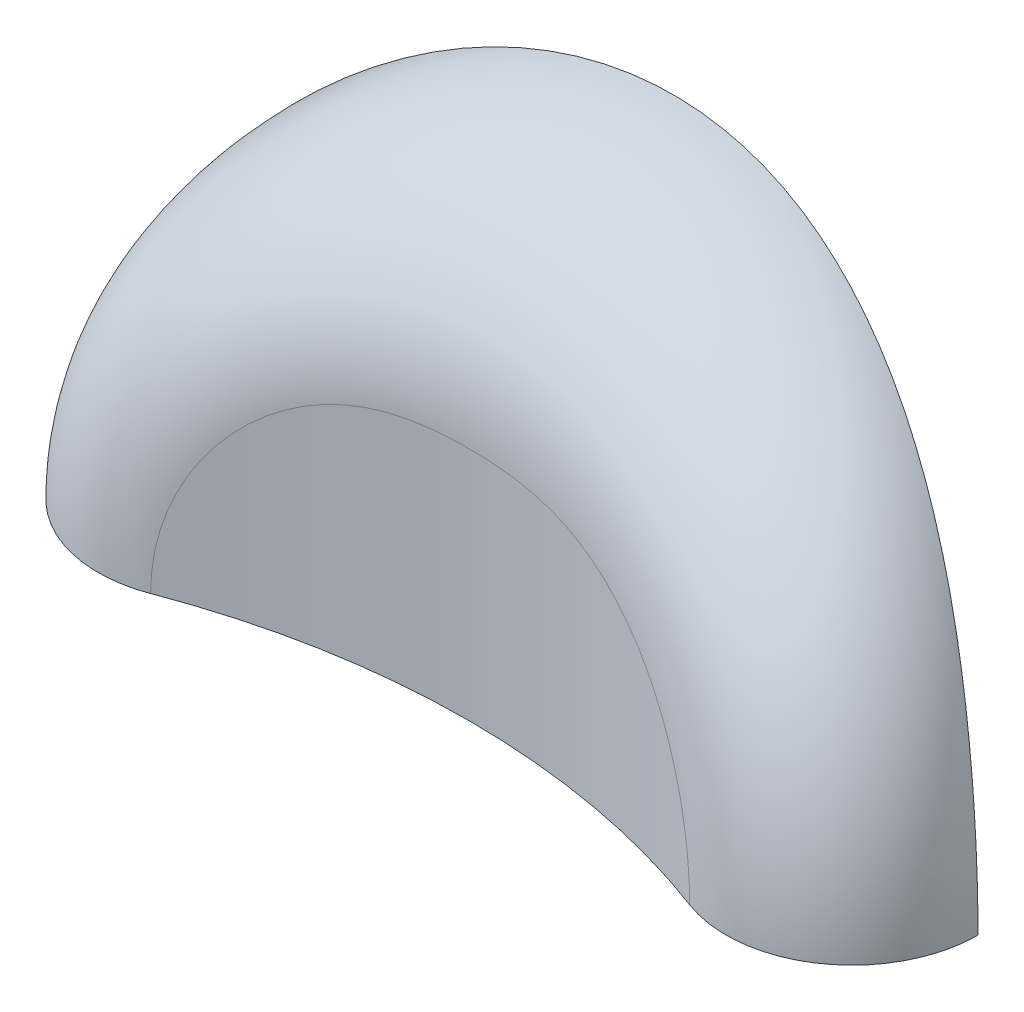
ISO-10303-21;
HEADER;
FILE_DESCRIPTION(('STEP AP214'),'2;1');
FILE_NAME('part.step','',(''),(''),'','','');
FILE_SCHEMA(('AUTOMOTIVE_DESIGN { 1 0 10303 214 1 1 1 1 }'));
ENDSEC;
DATA;
#1=APPLICATION_CONTEXT('core data for automotive mechanical design processes');
#2=APPLICATION_PROTOCOL_DEFINITION('international standard','automotive_design',2000,#1);
#3=PRODUCT_CONTEXT('',#1,'mechanical');
#4=PRODUCT('Part','Part','',(#3));
#5=PRODUCT_RELATED_PRODUCT_CATEGORY('part','',(#4));
#6=PRODUCT_DEFINITION_FORMATION('','',#4);
#7=PRODUCT_DEFINITION_CONTEXT('part definition',#1,'design');
#8=PRODUCT_DEFINITION('design','',#6,#7);
#9=PRODUCT_DEFINITION_SHAPE('','',#8);
#10=(LENGTH_UNIT() NAMED_UNIT(*) SI_UNIT(.MILLI.,.METRE.));
#11=(NAMED_UNIT(*) PLANE_ANGLE_UNIT() SI_UNIT($,.RADIAN.));
#12=(NAMED_UNIT(*) SI_UNIT($,.STERADIAN.) SOLID_ANGLE_UNIT());
#13=UNCERTAINTY_MEASURE_WITH_UNIT(LENGTH_MEASURE(1.E-05),#10,'distance_accuracy_value','');
#14=(GEOMETRIC_REPRESENTATION_CONTEXT(3) GLOBAL_UNCERTAINTY_ASSIGNED_CONTEXT((#13)) GLOBAL_UNIT_ASSIGNED_CONTEXT((#10,
#11,#12)) REPRESENTATION_CONTEXT('',''));
#15=CARTESIAN_POINT('',(0.,0.,0.));
#16=DIRECTION('',(0.,0.,1.));
#17=DIRECTION('',(1.,0.,0.));
#18=AXIS2_PLACEMENT_3D('',#15,#16,#17);
#19=CARTESIAN_POINT('',(34.667032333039,0.,-11.6037349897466));
#20=CARTESIAN_POINT('',(34.6670323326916,2.73339105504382,-11.6037349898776));
#21=CARTESIAN_POINT('',(34.3014194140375,5.40418410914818,-11.7436150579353));
#22=CARTESIAN_POINT('',(33.2676536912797,9.23480610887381,-12.1197615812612));
#23=CARTESIAN_POINT('',(32.8419577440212,10.4824758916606,-12.2725582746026));
#24=CARTESIAN_POINT('',(32.0880797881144,12.3001556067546,-12.5351882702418));
#25=CARTESIAN_POINT('',(31.8189166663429,12.8936277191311,-12.6278089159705));
#26=CARTESIAN_POINT('',(31.250160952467,14.0492982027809,-12.8204426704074));
#27=CARTESIAN_POINT('',(30.9501597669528,14.6124882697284,-12.9205977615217));
#28=CARTESIAN_POINT('',(30.0069790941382,16.2578796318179,-13.2299466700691));
#29=CARTESIAN_POINT('',(29.3207017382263,17.2959175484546,-13.4479739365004));
#30=CARTESIAN_POINT('',(27.85053430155,19.2524201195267,-13.8947998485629));
#31=CARTESIAN_POINT('',(27.066619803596,20.1708686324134,-14.1235983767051));
#32=CARTESIAN_POINT('',(25.8288221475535,21.4572687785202,-14.4664677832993));
#33=CARTESIAN_POINT('',(25.4071098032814,21.8694921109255,-14.5803630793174));
#34=CARTESIAN_POINT('',(24.5526733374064,22.6568933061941,-14.8048567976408));
#35=CARTESIAN_POINT('',(24.1192153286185,23.032841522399,-14.915659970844));
#36=CARTESIAN_POINT('',(22.8032892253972,24.1091901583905,-15.2422809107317));
#37=CARTESIAN_POINT('',(21.9053637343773,24.758083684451,-15.4522377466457));
#38=CARTESIAN_POINT('',(20.0827474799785,25.9277578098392,-15.850681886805));
#39=CARTESIAN_POINT('',(19.158067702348,26.4485047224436,-16.039181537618));
#40=CARTESIAN_POINT('',(17.7594819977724,27.1409666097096,-16.3030619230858));
#41=CARTESIAN_POINT('',(17.2905713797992,27.3573440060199,-16.3880245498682));
#42=CARTESIAN_POINT('',(16.3533019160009,27.7605065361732,-16.5508164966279));
#43=CARTESIAN_POINT('',(15.8870468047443,27.9464466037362,-16.6282935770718));
#44=CARTESIAN_POINT('',(13.5697493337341,28.8049225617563,-16.996438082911));
#45=CARTESIAN_POINT('',(11.7640638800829,29.2643611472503,-17.228971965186));
#46=CARTESIAN_POINT('',(9.12814643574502,29.7393209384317,-17.4987005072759));
#47=CARTESIAN_POINT('',(8.26094616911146,29.8618510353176,-17.5755198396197));
#48=CARTESIAN_POINT('',(6.97037100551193,30.006264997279,-17.6729561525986));
#49=CARTESIAN_POINT('',(6.54301577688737,30.0476556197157,-17.7023571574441));
#50=CARTESIAN_POINT('',(5.70128704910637,30.1187135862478,-17.7548812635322));
#51=CARTESIAN_POINT('',(5.28556813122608,30.1485380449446,-17.7781090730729));
#52=CARTESIAN_POINT('',(4.05038257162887,30.2244351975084,-17.8394254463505));
#53=CARTESIAN_POINT('',(3.24297896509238,30.2571933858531,-17.8692113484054));
#54=CARTESIAN_POINT('',(1.63947694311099,30.2997371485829,-17.9090450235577));
#55=CARTESIAN_POINT('',(0.843372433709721,30.3095519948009,-17.9191017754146));
#56=CARTESIAN_POINT('',(-0.360071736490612,30.3100573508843,-17.9196046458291));
#57=CARTESIAN_POINT('',(-0.76337194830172,30.3077781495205,-17.9173169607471));
#58=CARTESIAN_POINT('',(-1.57385101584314,30.2979526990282,-17.9076813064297));
#59=CARTESIAN_POINT('',(-1.97799441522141,30.2904480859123,-17.9003764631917));
#60=CARTESIAN_POINT('',(-3.19167095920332,30.2591074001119,-17.8709517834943));
#61=CARTESIAN_POINT('',(-4.00258574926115,30.2266848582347,-17.8413820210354));
#62=CARTESIAN_POINT('',(-5.64887810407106,30.1268623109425,-17.7604663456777));
#63=CARTESIAN_POINT('',(-6.48425719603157,30.0594288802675,-17.7091075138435));
#64=CARTESIAN_POINT('',(-7.76805428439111,29.9175578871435,-17.6129789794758));
#65=CARTESIAN_POINT('',(-8.20186589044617,29.8633118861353,-17.5776709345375));
#66=CARTESIAN_POINT('',(-9.07775736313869,29.7386188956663,-17.5003891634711));
#67=CARTESIAN_POINT('',(-9.51780936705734,29.668478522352,-17.4586040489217));
#68=CARTESIAN_POINT('',(-11.7310474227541,29.2726734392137,-17.2331869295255));
#69=CARTESIAN_POINT('',(-13.5468345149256,28.8121811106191,-16.9997615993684));
#70=CARTESIAN_POINT('',(-15.8727007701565,27.9520623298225,-16.6306502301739));
#71=CARTESIAN_POINT('',(-16.3411733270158,27.7654763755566,-16.5528638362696));
#72=CARTESIAN_POINT('',(-17.2792421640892,27.3624583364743,-16.3900500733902));
#73=CARTESIAN_POINT('',(-17.7470089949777,27.1468526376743,-16.3053509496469));
#74=CARTESIAN_POINT('',(-19.1448947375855,26.4555942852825,-16.0417930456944));
#75=CARTESIAN_POINT('',(-20.0697032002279,25.9354666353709,-15.8534096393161));
#76=CARTESIAN_POINT('',(-21.8936766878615,24.7662374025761,-15.4549148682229));
#77=CARTESIAN_POINT('',(-22.7928320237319,24.1171701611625,-15.2447904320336));
#78=CARTESIAN_POINT('',(-24.1113163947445,23.0395847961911,-14.9176629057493));
#79=CARTESIAN_POINT('',(-24.5457454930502,22.6630609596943,-14.8066486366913));
#80=CARTESIAN_POINT('',(-25.4023330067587,21.8741078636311,-14.5816461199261));
#81=CARTESIAN_POINT('',(-25.8254155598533,21.4606372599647,-14.4673921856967));
#82=CARTESIAN_POINT('',(-27.0611771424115,20.1768661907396,-14.1251441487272));
#83=CARTESIAN_POINT('',(-27.8431990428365,19.2611045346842,-13.8969479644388));
#84=CARTESIAN_POINT('',(-29.3090626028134,17.3124704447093,-13.4515916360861));
#85=CARTESIAN_POINT('',(-29.9929256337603,16.2796124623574,-13.2344328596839));
#86=CARTESIAN_POINT('',(-31.2458803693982,14.0993114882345,-12.8237258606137));
#87=CARTESIAN_POINT('',(-31.8150131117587,12.9518778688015,-12.6301782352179));
#88=CARTESIAN_POINT('',(-32.5679542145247,11.1462438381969,-12.3680783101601));
#89=CARTESIAN_POINT('',(-32.8025291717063,10.5290502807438,-12.2852783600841));
#90=CARTESIAN_POINT('',(-33.2333296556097,9.27212864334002,-12.1316546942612));
#91=CARTESIAN_POINT('',(-33.428454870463,8.63585919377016,-12.0612317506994));
#92=CARTESIAN_POINT('',(-34.3004000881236,5.41994460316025,-11.7440657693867));
#93=CARTESIAN_POINT('',(-34.6670323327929,2.73645168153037,-11.6037349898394));
#94=CARTESIAN_POINT('',(-34.6670323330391,0.,-11.6037349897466));
#95=CARTESIAN_POINT('',(56.5855164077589,0.,-3.34325914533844));
#96=CARTESIAN_POINT('',(56.5855164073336,4.42861086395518,-3.34325914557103));
#97=CARTESIAN_POINT('',(56.0760479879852,8.75221643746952,-3.63896382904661));
#98=CARTESIAN_POINT('',(54.6457309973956,14.9663334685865,-4.43198534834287));
#99=CARTESIAN_POINT('',(54.0578403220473,16.9927932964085,-4.75388784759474));
#100=CARTESIAN_POINT('',(53.0189521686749,19.9560976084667,-5.30728286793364));
#101=CARTESIAN_POINT('',(52.6483276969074,20.9255684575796,-5.50247316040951));
#102=CARTESIAN_POINT('',(51.8655704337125,22.8188928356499,-5.90869504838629));
#103=CARTESIAN_POINT('',(51.4528753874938,23.7443647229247,-6.12002609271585));
#104=CARTESIAN_POINT('',(50.1552983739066,26.4592151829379,-6.77359039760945));
#105=CARTESIAN_POINT('',(49.21117824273,28.1870489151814,-7.23526026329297));
#106=CARTESIAN_POINT('',(47.182060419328,31.4892299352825,-8.1868256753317));
#107=CARTESIAN_POINT('',(46.0970388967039,33.0636104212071,-8.67674802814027));
#108=CARTESIAN_POINT('',(44.3708681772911,35.3173240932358,-9.41804549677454));
#109=CARTESIAN_POINT('',(43.7806706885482,36.0482228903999,-9.66548660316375));
#110=CARTESIAN_POINT('',(42.5790428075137,37.4632281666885,-10.1560547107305));
#111=CARTESIAN_POINT('',(41.9665890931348,38.1486821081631,-10.3996245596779));
#112=CARTESIAN_POINT('',(40.0959873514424,40.1426009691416,-11.1225423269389));
#113=CARTESIAN_POINT('',(38.8047849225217,41.3887799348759,-11.5940019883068));
#114=CARTESIAN_POINT('',(36.1382494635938,43.7305699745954,-12.5046057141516));
#115=CARTESIAN_POINT('',(34.762913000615,44.826164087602,-12.9437846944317));
#116=CARTESIAN_POINT('',(32.6354318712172,46.3646942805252,-13.5718822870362));
#117=CARTESIAN_POINT('',(31.9142907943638,46.8607964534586,-13.7764751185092));
#118=CARTESIAN_POINT('',(30.4549031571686,47.8154504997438,-14.1731381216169));
#119=CARTESIAN_POINT('',(29.7199539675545,48.2719331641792,-14.3643396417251));
#120=CARTESIAN_POINT('',(26.0184784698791,50.4557563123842,-15.2841212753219));
#121=CARTESIAN_POINT('',(22.9741524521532,51.8912714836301,-15.9036510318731));
#122=CARTESIAN_POINT('',(18.2450950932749,53.6355565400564,-16.654886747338));
#123=CARTESIAN_POINT('',(16.6411898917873,54.1480581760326,-16.8757108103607));
#124=CARTESIAN_POINT('',(14.1846717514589,54.8135325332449,-17.16184542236));
#125=CARTESIAN_POINT('',(13.3595376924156,55.0173556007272,-17.2493817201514));
#126=CARTESIAN_POINT('',(11.7134413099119,55.3856204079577,-17.4073437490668));
#127=CARTESIAN_POINT('',(10.8899312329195,55.5507711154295,-17.4780756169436));
#128=CARTESIAN_POINT('',(8.41637387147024,55.9909054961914,-17.6663411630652));
#129=CARTESIAN_POINT('',(6.76331873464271,56.210782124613,-17.7600412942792));
#130=CARTESIAN_POINT('',(3.44007574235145,56.5067913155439,-17.886034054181));
#131=CARTESIAN_POINT('',(1.7699095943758,56.5829284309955,-17.9183463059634));
#132=CARTESIAN_POINT('',(-0.755649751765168,56.5867135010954,-17.9199540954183));
#133=CARTESIAN_POINT('',(-1.60211515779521,56.5694641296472,-17.9126291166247));
#134=CARTESIAN_POINT('',(-3.29803956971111,56.4971538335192,-17.8818988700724));
#135=CARTESIAN_POINT('',(-4.14112610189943,56.4424205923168,-17.858632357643));
#136=CARTESIAN_POINT('',(-6.65792462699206,56.2236321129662,-17.7655162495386));
#137=CARTESIAN_POINT('',(-8.31922107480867,56.0052027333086,-17.6724427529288));
#138=CARTESIAN_POINT('',(-11.6188426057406,55.42389169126,-17.4238166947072));
#139=CARTESIAN_POINT('',(-13.2571538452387,55.0610157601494,-17.2682370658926));
#140=CARTESIAN_POINT('',(-15.7040082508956,54.4036399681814,-16.9856120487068));
#141=CARTESIAN_POINT('',(-16.5193114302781,54.1651465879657,-16.8829740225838));
#142=CARTESIAN_POINT('',(-18.1408084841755,53.6509738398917,-16.6615678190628));
#143=CARTESIAN_POINT('',(-18.9432928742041,53.3765489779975,-16.543339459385));
#144=CARTESIAN_POINT('',(-22.9182578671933,51.9174452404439,-15.9149119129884));
#145=CARTESIAN_POINT('',(-25.9809625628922,50.4757574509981,-15.2926449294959));
#146=CARTESIAN_POINT('',(-29.6972621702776,48.2858427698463,-14.3701737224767));
#147=CARTESIAN_POINT('',(-30.4358667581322,47.8274921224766,-14.1781675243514));
#148=CARTESIAN_POINT('',(-31.8967981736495,46.8726400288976,-13.7813707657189));
#149=CARTESIAN_POINT('',(-32.6163142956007,46.3780531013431,-13.5773739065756));
#150=CARTESIAN_POINT('',(-34.743157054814,44.8413650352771,-12.9499160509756));
#151=CARTESIAN_POINT('',(-36.1189596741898,43.7464841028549,-12.510915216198));
#152=CARTESIAN_POINT('',(-38.7878893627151,41.4046304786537,-11.600045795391));
#153=CARTESIAN_POINT('',(-40.0810227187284,40.1576776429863,-11.1281414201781));
#154=CARTESIAN_POINT('',(-41.9554097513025,38.161029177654,-10.404035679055));
#155=CARTESIAN_POINT('',(-42.5692734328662,37.4744025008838,-10.159983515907));
#156=CARTESIAN_POINT('',(-43.7739790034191,36.0564281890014,-9.66827726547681));
#157=CARTESIAN_POINT('',(-44.3661036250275,35.3232828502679,-9.42005195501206));
#158=CARTESIAN_POINT('',(-46.0894764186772,33.0740040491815,-8.68007443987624));
#159=CARTESIAN_POINT('',(-47.1719080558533,31.5040961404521,-8.19142347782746));
#160=CARTESIAN_POINT('',(-49.1951418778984,28.2147808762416,-7.24294170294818));
#161=CARTESIAN_POINT('',(-50.1359613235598,26.4953384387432,-6.78308746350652));
#162=CARTESIAN_POINT('',(-51.859714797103,22.8973792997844,-5.91534536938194));
#163=CARTESIAN_POINT('',(-52.6426848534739,21.0188161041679,-5.50744272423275));
#164=CARTESIAN_POINT('',(-53.6802311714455,18.0748020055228,-4.95515899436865));
#165=CARTESIAN_POINT('',(-54.0037652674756,17.070445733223,-4.78071586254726));
#166=CARTESIAN_POINT('',(-54.5985237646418,15.0276069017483,-4.45700710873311));
#167=CARTESIAN_POINT('',(-54.8682248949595,13.9947344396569,-4.30858649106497));
#168=CARTESIAN_POINT('',(-56.0746005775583,8.77768486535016,-3.63992059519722));
#169=CARTESIAN_POINT('',(-56.5855164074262,4.43359867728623,-3.34325914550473));
#170=CARTESIAN_POINT('',(-56.5855164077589,0.,-3.3432591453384));
#171=CARTESIAN_POINT('',(56.5855164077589,0.,-26.766653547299));
#172=CARTESIAN_POINT('',(56.5855164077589,3.82974800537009,-26.7666535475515));
#173=CARTESIAN_POINT('',(56.2009537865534,7.57414879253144,-27.0318325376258));
#174=CARTESIAN_POINT('',(55.0862838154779,13.0736593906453,-27.7686164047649));
#175=CARTESIAN_POINT('',(54.6243207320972,14.8872619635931,-28.0706102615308));
#176=CARTESIAN_POINT('',(53.7939236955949,17.5788514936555,-28.6000811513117));
#177=CARTESIAN_POINT('',(53.4956546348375,18.4661689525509,-28.7883524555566));
#178=CARTESIAN_POINT('',(52.8603569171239,20.2130434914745,-29.1841121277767));
#179=CARTESIAN_POINT('',(52.5228787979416,21.0740666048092,-29.3918873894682));
#180=CARTESIAN_POINT('',(51.4522866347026,23.6215266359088,-30.0413888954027));
#181=CARTESIAN_POINT('',(50.661194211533,25.272458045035,-30.5092316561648));
#182=CARTESIAN_POINT('',(48.926751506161,28.4855528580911,-31.4975932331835));
#183=CARTESIAN_POINT('',(47.983397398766,30.0477070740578,-32.0181381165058));
#184=CARTESIAN_POINT('',(46.4517130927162,32.3264076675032,-32.8269401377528));
#185=CARTESIAN_POINT('',(45.9231430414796,33.0728418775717,-33.1004054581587));
#186=CARTESIAN_POINT('',(44.8364820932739,34.5316928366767,-33.6498267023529));
#187=CARTESIAN_POINT('',(44.2774859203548,35.245469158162,-33.9262637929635));
#188=CARTESIAN_POINT('',(42.5537530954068,37.3412843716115,-34.7579109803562));
#189=CARTESIAN_POINT('',(41.342407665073,38.6779523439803,-35.3154243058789));
#190=CARTESIAN_POINT('',(38.7933303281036,41.2341629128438,-36.4226219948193));
#191=CARTESIAN_POINT('',(37.4556097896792,42.4537016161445,-36.9723414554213));
#192=CARTESIAN_POINT('',(35.3493722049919,44.1947084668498,-37.781086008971));
#193=CARTESIAN_POINT('',(34.6294495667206,44.7611815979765,-38.0484566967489));
#194=CARTESIAN_POINT('',(33.1603570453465,45.8601447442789,-38.5743292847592));
#195=CARTESIAN_POINT('',(32.4145266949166,46.3902306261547,-38.8316631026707));
#196=CARTESIAN_POINT('',(28.6289770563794,48.9454010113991,-40.0870510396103));
#197=CARTESIAN_POINT('',(25.4217765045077,50.6879807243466,-40.9914699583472));
#198=CARTESIAN_POINT('',(20.3229190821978,52.8422557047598,-42.1357348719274));
#199=CARTESIAN_POINT('',(18.5749670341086,53.483124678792,-42.4817338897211));
#200=CARTESIAN_POINT('',(15.8745152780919,54.3213472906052,-42.9385416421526));
#201=CARTESIAN_POINT('',(14.9636266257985,54.5792684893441,-43.0799303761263));
#202=CARTESIAN_POINT('',(13.1400411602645,55.0467618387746,-43.3372403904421));
#203=CARTESIAN_POINT('',(12.2245473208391,55.2572269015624,-43.4536482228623));
#204=CARTESIAN_POINT('',(9.467014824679,55.8194980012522,-43.7655971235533));
#205=CARTESIAN_POINT('',(7.61394844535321,56.1023523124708,-43.9238935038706));
#206=CARTESIAN_POINT('',(3.8781082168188,56.483682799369,-44.1376812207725));
#207=CARTESIAN_POINT('',(1.99533682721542,56.5821729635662,-44.1931833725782));
#208=CARTESIAN_POINT('',(-0.851894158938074,56.5870629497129,-44.1959346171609));
#209=CARTESIAN_POINT('',(-1.80619565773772,56.5647697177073,-44.1833858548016));
#210=CARTESIAN_POINT('',(-3.71687085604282,56.4714121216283,-44.1309029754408));
#211=CARTESIAN_POINT('',(-4.66606102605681,56.4007715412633,-44.0912076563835));
#212=CARTESIAN_POINT('',(-7.49571427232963,56.1188817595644,-43.9331434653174));
#213=CARTESIAN_POINT('',(-9.35829964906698,55.837845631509,-43.7758341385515));
#214=CARTESIAN_POINT('',(-13.0375264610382,55.0950604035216,-43.3636235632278));
#215=CARTESIAN_POINT('',(-14.8541641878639,54.6333011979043,-43.1087063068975));
#216=CARTESIAN_POINT('',(-17.5450504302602,53.8049500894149,-42.6570485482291));
#217=CARTESIAN_POINT('',(-18.4379177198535,53.5055849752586,-42.49462706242));
#218=CARTESIAN_POINT('',(-20.2050912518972,52.8635859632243,-42.1486853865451));
#219=CARTESIAN_POINT('',(-21.0753681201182,52.5225171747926,-41.9660074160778));
#220=CARTESIAN_POINT('',(-25.3628090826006,50.7197509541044,-41.0079515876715));
#221=CARTESIAN_POINT('',(-28.5900679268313,48.969177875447,-40.0990225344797));
#222=CARTESIAN_POINT('',(-32.3914518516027,46.4064138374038,-38.8395432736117));
#223=CARTESIAN_POINT('',(-33.1410927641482,45.8740844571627,-38.5810619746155));
#224=CARTESIAN_POINT('',(-34.6119394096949,44.7747395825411,-38.0548836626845));
#225=CARTESIAN_POINT('',(-35.3303358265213,44.2099185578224,-37.788229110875));
#226=CARTESIAN_POINT('',(-37.4362660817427,42.4707204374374,-36.9800950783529));
#227=CARTESIAN_POINT('',(-38.774681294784,41.2517495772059,-36.430435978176));
#228=CARTESIAN_POINT('',(-41.326462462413,38.6950417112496,-35.3226325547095));
#229=CARTESIAN_POINT('',(-42.5398196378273,37.3573111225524,-34.7644528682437));
#230=CARTESIAN_POINT('',(-44.2672551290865,35.2583587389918,-33.9312887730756));
#231=CARTESIAN_POINT('',(-44.8276000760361,34.5432787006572,-33.6542603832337));
#232=CARTESIAN_POINT('',(-45.9171382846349,33.0812370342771,-33.1034978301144));
#233=CARTESIAN_POINT('',(-46.4474532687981,32.3324815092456,-32.8291522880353));
#234=CARTESIAN_POINT('',(-47.9767506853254,30.0581186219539,-32.0217218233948));
#235=CARTESIAN_POINT('',(-48.9179364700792,28.5002782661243,-31.5024687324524));
#236=CARTESIAN_POINT('',(-50.6476219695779,25.2991849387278,-30.5171115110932));
#237=CARTESIAN_POINT('',(-51.436120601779,23.6559379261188,-30.0509834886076));
#238=CARTESIAN_POINT('',(-52.8587560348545,20.2788020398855,-29.1883265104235));
#239=CARTESIAN_POINT('',(-53.4929237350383,18.5449347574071,-28.791770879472));
#240=CARTESIAN_POINT('',(-54.3226070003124,15.8696799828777,-28.2630945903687));
#241=CARTESIAN_POINT('',(-54.5793077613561,14.9637024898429,-28.0976209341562));
#242=CARTESIAN_POINT('',(-55.0484174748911,13.1333530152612,-27.7926797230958));
#243=CARTESIAN_POINT('',(-55.2596398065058,12.213979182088,-27.6539965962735));
#244=CARTESIAN_POINT('',(-56.1999698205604,7.59596269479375,-27.0326126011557));
#245=CARTESIAN_POINT('',(-56.5855164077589,3.83413541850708,-26.7666535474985));
#246=CARTESIAN_POINT('',(-56.5855164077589,0.,-26.766653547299));
#247=(BOUNDED_SURFACE() B_SPLINE_SURFACE(2,3,((#19,#20,#21,#22,#23,#24,#25,#26,#27,#28,#29,#30,
#31,#32,#33,#34,#35,#36,#37,#38,#39,#40,#41,#42,#43,#44,#45,#46,#47,#48,#49,#50,#51,#52,#53,#54,
#55,#56,#57,#58,#59,#60,#61,#62,#63,#64,#65,#66,#67,#68,#69,#70,#71,#72,#73,#74,#75,#76,#77,#78,
#79,#80,#81,#82,#83,#84,#85,#86,#87,#88,#89,#90,#91,#92,#93,#94),(#95,#96,#97,#98,#99,#100,#101,
#102,#103,#104,#105,#106,#107,#108,#109,#110,#111,#112,#113,#114,#115,#116,#117,#118,#119,#120,
#121,#122,#123,#124,#125,#126,#127,#128,#129,#130,#131,#132,#133,#134,#135,#136,#137,#138,#139,
#140,#141,#142,#143,#144,#145,#146,#147,#148,#149,#150,#151,#152,#153,#154,#155,#156,#157,#158,
#159,#160,#161,#162,#163,#164,#165,#166,#167,#168,#169,#170),(#171,#172,#173,#174,#175,#176,
#177,#178,#179,#180,#181,#182,#183,#184,#185,#186,#187,#188,#189,#190,#191,#192,#193,#194,#195,
#196,#197,#198,#199,#200,#201,#202,#203,#204,#205,#206,#207,#208,#209,#210,#211,#212,#213,#214,
#215,#216,#217,#218,#219,#220,#221,#222,#223,#224,#225,#226,#227,#228,#229,#230,#231,#232,#233,
#234,#235,#236,#237,#238,#239,#240,#241,#242,#243,#244,#245,#246)),.UNSPECIFIED.,.F.,.F.,
.F.) B_SPLINE_SURFACE_WITH_KNOTS((3,3),(4,2,2,2,2,2,2,2,2,2,2,2,2,2,2,2,2,2,2,2,2,2,2,2,2,2,2,2,
2,2,2,2,2,2,2,2,2,4),(0.,1.),(0.,0.01130082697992,0.01695124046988,0.0197764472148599,
0.0226016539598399,0.0282520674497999,0.0339024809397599,0.0367276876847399,0.0395528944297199,
0.0452033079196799,0.0508537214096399,0.0536789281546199,0.0565041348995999,0.0678049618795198,
0.0734553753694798,0.0762805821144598,0.0791057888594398,0.0847562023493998,0.0904066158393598,
0.0932318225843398,0.0960570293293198,0.10170744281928,0.10735785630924,0.11018306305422,
0.1130082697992,0.12430909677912,0.1271343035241,0.12995951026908,0.13560992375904,
0.141260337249,0.14408554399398,0.14691075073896,0.15256116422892,0.15821157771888,
0.16386199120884,0.16668719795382,0.1695124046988,0.18081323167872),
.UNSPECIFIED.) GEOMETRIC_REPRESENTATION_ITEM() RATIONAL_B_SPLINE_SURFACE(((1.,1.,1.,1.,1.,1.,1.,
1.,1.,1.,1.,1.,1.,1.,1.,1.,1.,1.,1.,1.,1.,1.,1.,1.,1.,1.,1.,1.,1.,1.,1.,1.,1.,1.,1.,1.,1.,1.,1.,
1.,1.,1.,1.,1.,1.,1.,1.,1.,1.,1.,1.,1.,1.,1.,1.,1.,1.,1.,1.,1.,1.,1.,1.,1.,1.,1.,1.,1.,1.,1.,1.,
1.,1.,1.,1.,1.),(0.568920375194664,0.568910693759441,0.571652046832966,0.579041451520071,
0.582048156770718,0.587238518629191,0.589072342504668,0.592896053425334,0.594888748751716,
0.60106256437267,0.605438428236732,0.614485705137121,0.619157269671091,0.626240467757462,
0.628607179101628,0.633302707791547,0.63563575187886,0.642563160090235,0.64708481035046,
0.655815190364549,0.660024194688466,0.666035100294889,0.667991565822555,0.671781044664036,
0.673605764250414,0.682373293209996,0.688241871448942,0.695316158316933,0.697387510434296,
0.70006381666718,0.700881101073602,0.702353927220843,0.703012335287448,0.704762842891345,
0.705631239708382,0.706798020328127,0.707096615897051,0.707111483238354,0.707043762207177,
0.706759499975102,0.706544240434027,0.70568197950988,0.704819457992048,0.702507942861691,
0.701058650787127,0.698415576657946,0.697454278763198,0.695376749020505,0.694265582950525,
0.688348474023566,0.682454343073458,0.673661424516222,0.671829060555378,0.668038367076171,
0.666087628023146,0.660082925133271,0.655875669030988,0.647142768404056,0.642616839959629,
0.635678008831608,0.633340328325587,0.628633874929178,0.626259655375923,0.619189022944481,
0.614529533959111,0.60551134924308,0.601152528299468,0.592955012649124,0.589116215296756,
0.58393573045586,0.58230252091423,0.579276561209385,0.577891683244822,0.571660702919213,
0.56890972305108,0.568920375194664),(1.,1.,1.,1.,1.,1.,1.,1.,1.,1.,1.,1.,1.,1.,1.,1.,1.,1.,1.,
1.,1.,1.,1.,1.,1.,1.,1.,1.,1.,1.,1.,1.,1.,1.,1.,1.,1.,1.,1.,1.,1.,1.,1.,1.,1.,1.,1.,1.,1.,1.,1.,
1.,1.,1.,1.,1.,1.,1.,1.,1.,1.,1.,1.,1.,1.,1.,1.,1.,1.,1.,1.,1.,1.,1.,1.,1.))) REPRESENTATION_ITEM('') SURFACE());
#248=CARTESIAN_POINT('',(56.5855164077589,0.,-26.766653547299));
#249=CARTESIAN_POINT('',(56.5855164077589,3.82974800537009,-26.7666535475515));
#250=CARTESIAN_POINT('',(56.2009537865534,7.57414879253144,-27.0318325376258));
#251=CARTESIAN_POINT('',(55.0862838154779,13.0736593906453,-27.7686164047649));
#252=CARTESIAN_POINT('',(54.6243207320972,14.8872619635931,-28.0706102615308));
#253=CARTESIAN_POINT('',(53.7939236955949,17.5788514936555,-28.6000811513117));
#254=CARTESIAN_POINT('',(53.4956546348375,18.4661689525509,-28.7883524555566));
#255=CARTESIAN_POINT('',(52.8603569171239,20.2130434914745,-29.1841121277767));
#256=CARTESIAN_POINT('',(52.5228787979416,21.0740666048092,-29.3918873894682));
#257=CARTESIAN_POINT('',(51.4522866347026,23.6215266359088,-30.0413888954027));
#258=CARTESIAN_POINT('',(50.661194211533,25.272458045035,-30.5092316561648));
#259=CARTESIAN_POINT('',(48.926751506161,28.4855528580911,-31.4975932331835));
#260=CARTESIAN_POINT('',(47.983397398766,30.0477070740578,-32.0181381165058));
#261=CARTESIAN_POINT('',(46.4517130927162,32.3264076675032,-32.8269401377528));
#262=CARTESIAN_POINT('',(45.9231430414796,33.0728418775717,-33.1004054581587));
#263=CARTESIAN_POINT('',(44.8364820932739,34.5316928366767,-33.6498267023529));
#264=CARTESIAN_POINT('',(44.2774859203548,35.245469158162,-33.9262637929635));
#265=CARTESIAN_POINT('',(42.5537530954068,37.3412843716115,-34.7579109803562));
#266=CARTESIAN_POINT('',(41.342407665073,38.6779523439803,-35.3154243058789));
#267=CARTESIAN_POINT('',(38.7933303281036,41.2341629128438,-36.4226219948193));
#268=CARTESIAN_POINT('',(37.4556097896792,42.4537016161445,-36.9723414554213));
#269=CARTESIAN_POINT('',(35.3493722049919,44.1947084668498,-37.781086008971));
#270=CARTESIAN_POINT('',(34.6294495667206,44.7611815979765,-38.0484566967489));
#271=CARTESIAN_POINT('',(33.1603570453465,45.8601447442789,-38.5743292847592));
#272=CARTESIAN_POINT('',(32.4145266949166,46.3902306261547,-38.8316631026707));
#273=CARTESIAN_POINT('',(28.6289770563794,48.9454010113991,-40.0870510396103));
#274=CARTESIAN_POINT('',(25.4217765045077,50.6879807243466,-40.9914699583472));
#275=CARTESIAN_POINT('',(20.3229190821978,52.8422557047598,-42.1357348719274));
#276=CARTESIAN_POINT('',(18.5749670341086,53.483124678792,-42.4817338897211));
#277=CARTESIAN_POINT('',(15.8745152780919,54.3213472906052,-42.9385416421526));
#278=CARTESIAN_POINT('',(14.9636266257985,54.5792684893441,-43.0799303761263));
#279=CARTESIAN_POINT('',(13.1400411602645,55.0467618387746,-43.3372403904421));
#280=CARTESIAN_POINT('',(12.2245473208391,55.2572269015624,-43.4536482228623));
#281=CARTESIAN_POINT('',(9.467014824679,55.8194980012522,-43.7655971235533));
#282=CARTESIAN_POINT('',(7.61394844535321,56.1023523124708,-43.9238935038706));
#283=CARTESIAN_POINT('',(3.8781082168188,56.483682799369,-44.1376812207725));
#284=CARTESIAN_POINT('',(1.99533682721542,56.5821729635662,-44.1931833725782));
#285=CARTESIAN_POINT('',(-0.851894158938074,56.5870629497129,-44.1959346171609));
#286=CARTESIAN_POINT('',(-1.80619565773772,56.5647697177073,-44.1833858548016));
#287=CARTESIAN_POINT('',(-3.71687085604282,56.4714121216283,-44.1309029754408));
#288=CARTESIAN_POINT('',(-4.66606102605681,56.4007715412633,-44.0912076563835));
#289=CARTESIAN_POINT('',(-7.49571427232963,56.1188817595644,-43.9331434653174));
#290=CARTESIAN_POINT('',(-9.35829964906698,55.837845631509,-43.7758341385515));
#291=CARTESIAN_POINT('',(-13.0375264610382,55.0950604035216,-43.3636235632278));
#292=CARTESIAN_POINT('',(-14.8541641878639,54.6333011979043,-43.1087063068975));
#293=CARTESIAN_POINT('',(-17.5450504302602,53.8049500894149,-42.6570485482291));
#294=CARTESIAN_POINT('',(-18.4379177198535,53.5055849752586,-42.49462706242));
#295=CARTESIAN_POINT('',(-20.2050912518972,52.8635859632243,-42.1486853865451));
#296=CARTESIAN_POINT('',(-21.0753681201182,52.5225171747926,-41.9660074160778));
#297=CARTESIAN_POINT('',(-25.3628090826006,50.7197509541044,-41.0079515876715));
#298=CARTESIAN_POINT('',(-28.5900679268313,48.969177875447,-40.0990225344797));
#299=CARTESIAN_POINT('',(-32.3914518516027,46.4064138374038,-38.8395432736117));
#300=CARTESIAN_POINT('',(-33.1410927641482,45.8740844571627,-38.5810619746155));
#301=CARTESIAN_POINT('',(-34.6119394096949,44.7747395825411,-38.0548836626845));
#302=CARTESIAN_POINT('',(-35.3303358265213,44.2099185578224,-37.788229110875));
#303=CARTESIAN_POINT('',(-37.4362660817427,42.4707204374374,-36.9800950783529));
#304=CARTESIAN_POINT('',(-38.774681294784,41.2517495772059,-36.430435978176));
#305=CARTESIAN_POINT('',(-41.326462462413,38.6950417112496,-35.3226325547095));
#306=CARTESIAN_POINT('',(-42.5398196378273,37.3573111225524,-34.7644528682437));
#307=CARTESIAN_POINT('',(-44.2672551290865,35.2583587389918,-33.9312887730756));
#308=CARTESIAN_POINT('',(-44.8276000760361,34.5432787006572,-33.6542603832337));
#309=CARTESIAN_POINT('',(-45.9171382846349,33.0812370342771,-33.1034978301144));
#310=CARTESIAN_POINT('',(-46.4474532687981,32.3324815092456,-32.8291522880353));
#311=CARTESIAN_POINT('',(-47.9767506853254,30.0581186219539,-32.0217218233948));
#312=CARTESIAN_POINT('',(-48.9179364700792,28.5002782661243,-31.5024687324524));
#313=CARTESIAN_POINT('',(-50.6476219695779,25.2991849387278,-30.5171115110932));
#314=CARTESIAN_POINT('',(-51.436120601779,23.6559379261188,-30.0509834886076));
#315=CARTESIAN_POINT('',(-52.8587560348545,20.2788020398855,-29.1883265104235));
#316=CARTESIAN_POINT('',(-53.4929237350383,18.5449347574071,-28.791770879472));
#317=CARTESIAN_POINT('',(-54.3226070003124,15.8696799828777,-28.2630945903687));
#318=CARTESIAN_POINT('',(-54.5793077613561,14.9637024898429,-28.0976209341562));
#319=CARTESIAN_POINT('',(-55.0484174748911,13.1333530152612,-27.7926797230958));
#320=CARTESIAN_POINT('',(-55.2596398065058,12.213979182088,-27.6539965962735));
#321=CARTESIAN_POINT('',(-56.1999698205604,7.59596269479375,-27.0326126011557));
#322=CARTESIAN_POINT('',(-56.5855164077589,3.83413541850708,-26.7666535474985));
#323=CARTESIAN_POINT('',(-56.5855164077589,0.,-26.766653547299));
#324=(BOUNDED_CURVE() B_SPLINE_CURVE(3,(#248,#249,#250,#251,#252,#253,#254,#255,#256,#257,#258,
#259,#260,#261,#262,#263,#264,#265,#266,#267,#268,#269,#270,#271,#272,#273,#274,#275,#276,#277,
#278,#279,#280,#281,#282,#283,#284,#285,#286,#287,#288,#289,#290,#291,#292,#293,#294,#295,#296,
#297,#298,#299,#300,#301,#302,#303,#304,#305,#306,#307,#308,#309,#310,#311,#312,#313,#314,#315,
#316,#317,#318,#319,#320,#321,#322,#323),.UNSPECIFIED.,.F.,.F.) B_SPLINE_CURVE_WITH_KNOTS((4,2,
2,2,2,2,2,2,2,2,2,2,2,2,2,2,2,2,2,2,2,2,2,2,2,2,2,2,2,2,2,2,2,2,2,2,2,4),(0.,0.01130082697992,
0.01695124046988,0.0197764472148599,0.0226016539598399,0.0282520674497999,0.0339024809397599,
0.0367276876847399,0.0395528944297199,0.0452033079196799,0.0508537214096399,0.0536789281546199,
0.0565041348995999,0.0678049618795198,0.0734553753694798,0.0762805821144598,0.0791057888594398,
0.0847562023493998,0.0904066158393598,0.0932318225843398,0.0960570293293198,0.10170744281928,
0.10735785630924,0.11018306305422,0.1130082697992,0.12430909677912,0.1271343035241,
0.12995951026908,0.13560992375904,0.141260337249,0.14408554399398,0.14691075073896,
0.15256116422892,0.15821157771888,0.16386199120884,0.16668719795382,0.1695124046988,
0.18081323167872),
.UNSPECIFIED.) CURVE() GEOMETRIC_REPRESENTATION_ITEM() RATIONAL_B_SPLINE_CURVE((1.,1.,1.,1.,1.,
1.,1.,1.,1.,1.,1.,1.,1.,1.,1.,1.,1.,1.,1.,1.,1.,1.,1.,1.,1.,1.,1.,1.,1.,1.,1.,1.,1.,1.,1.,1.,1.,
1.,1.,1.,1.,1.,1.,1.,1.,1.,1.,1.,1.,1.,1.,1.,1.,1.,1.,1.,1.,1.,1.,1.,1.,1.,1.,1.,1.,1.,1.,1.,1.,
1.,1.,1.,1.,1.,1.,1.)) REPRESENTATION_ITEM(''));
#325=CARTESIAN_POINT('',(56.5855164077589,0.,-26.766653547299));
#326=VERTEX_POINT('',#325);
#327=CARTESIAN_POINT('',(-56.5855164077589,0.,-26.766653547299));
#328=VERTEX_POINT('',#327);
#329=EDGE_CURVE('E70',#326,#328,#324,.T.);
#330=CARTESIAN_POINT('',(-56.5855164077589,0.,-26.766653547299));
#331=CARTESIAN_POINT('',(-56.5855164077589,0.,-3.3432591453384));
#332=CARTESIAN_POINT('',(-34.6670323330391,0.,-11.6037349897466));
#333=(BOUNDED_CURVE() B_SPLINE_CURVE(2,(#330,#331,#332),.UNSPECIFIED.,.F.,
.F.) B_SPLINE_CURVE_WITH_KNOTS((3,3),(0.,1.),
.UNSPECIFIED.) CURVE() GEOMETRIC_REPRESENTATION_ITEM() RATIONAL_B_SPLINE_CURVE((1.,
0.568920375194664,1.)) REPRESENTATION_ITEM(''));
#334=CARTESIAN_POINT('',(-34.6670323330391,0.,-11.6037349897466));
#335=VERTEX_POINT('',#334);
#336=EDGE_CURVE('E11',#335,#328,#333,.F.);
#337=CARTESIAN_POINT('',(-34.6670323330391,0.,-11.6037349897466));
#338=CARTESIAN_POINT('',(-34.6670323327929,2.73645168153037,-11.6037349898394));
#339=CARTESIAN_POINT('',(-34.3004000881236,5.41994460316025,-11.7440657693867));
#340=CARTESIAN_POINT('',(-33.428454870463,8.63585919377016,-12.0612317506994));
#341=CARTESIAN_POINT('',(-33.2333296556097,9.27212864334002,-12.1316546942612));
#342=CARTESIAN_POINT('',(-32.8025291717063,10.5290502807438,-12.2852783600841));
#343=CARTESIAN_POINT('',(-32.5679542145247,11.1462438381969,-12.3680783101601));
#344=CARTESIAN_POINT('',(-31.8150131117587,12.9518778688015,-12.6301782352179));
#345=CARTESIAN_POINT('',(-31.2458803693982,14.0993114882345,-12.8237258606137));
#346=CARTESIAN_POINT('',(-29.9929256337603,16.2796124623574,-13.2344328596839));
#347=CARTESIAN_POINT('',(-29.3090626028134,17.3124704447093,-13.4515916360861));
#348=CARTESIAN_POINT('',(-27.8431990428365,19.2611045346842,-13.8969479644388));
#349=CARTESIAN_POINT('',(-27.0611771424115,20.1768661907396,-14.1251441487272));
#350=CARTESIAN_POINT('',(-25.8254155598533,21.4606372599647,-14.4673921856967));
#351=CARTESIAN_POINT('',(-25.4023330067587,21.8741078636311,-14.5816461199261));
#352=CARTESIAN_POINT('',(-24.5457454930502,22.6630609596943,-14.8066486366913));
#353=CARTESIAN_POINT('',(-24.1113163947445,23.0395847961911,-14.9176629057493));
#354=CARTESIAN_POINT('',(-22.7928320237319,24.1171701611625,-15.2447904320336));
#355=CARTESIAN_POINT('',(-21.8936766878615,24.7662374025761,-15.4549148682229));
#356=CARTESIAN_POINT('',(-20.0697032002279,25.9354666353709,-15.8534096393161));
#357=CARTESIAN_POINT('',(-19.1448947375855,26.4555942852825,-16.0417930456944));
#358=CARTESIAN_POINT('',(-17.7470089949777,27.1468526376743,-16.3053509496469));
#359=CARTESIAN_POINT('',(-17.2792421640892,27.3624583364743,-16.3900500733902));
#360=CARTESIAN_POINT('',(-16.3411733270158,27.7654763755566,-16.5528638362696));
#361=CARTESIAN_POINT('',(-15.8727007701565,27.9520623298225,-16.6306502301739));
#362=CARTESIAN_POINT('',(-13.5468345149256,28.8121811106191,-16.9997615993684));
#363=CARTESIAN_POINT('',(-11.7310474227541,29.2726734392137,-17.2331869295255));
#364=CARTESIAN_POINT('',(-9.51780936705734,29.668478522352,-17.4586040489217));
#365=CARTESIAN_POINT('',(-9.07775736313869,29.7386188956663,-17.5003891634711));
#366=CARTESIAN_POINT('',(-8.20186589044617,29.8633118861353,-17.5776709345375));
#367=CARTESIAN_POINT('',(-7.76805428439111,29.9175578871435,-17.6129789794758));
#368=CARTESIAN_POINT('',(-6.48425719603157,30.0594288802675,-17.7091075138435));
#369=CARTESIAN_POINT('',(-5.64887810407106,30.1268623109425,-17.7604663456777));
#370=CARTESIAN_POINT('',(-4.00258574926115,30.2266848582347,-17.8413820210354));
#371=CARTESIAN_POINT('',(-3.19167095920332,30.2591074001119,-17.8709517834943));
#372=CARTESIAN_POINT('',(-1.97799441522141,30.2904480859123,-17.9003764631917));
#373=CARTESIAN_POINT('',(-1.57385101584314,30.2979526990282,-17.9076813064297));
#374=CARTESIAN_POINT('',(-0.76337194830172,30.3077781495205,-17.9173169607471));
#375=CARTESIAN_POINT('',(-0.360071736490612,30.3100573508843,-17.9196046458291));
#376=CARTESIAN_POINT('',(0.843372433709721,30.3095519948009,-17.9191017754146));
#377=CARTESIAN_POINT('',(1.63947694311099,30.2997371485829,-17.9090450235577));
#378=CARTESIAN_POINT('',(3.24297896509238,30.2571933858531,-17.8692113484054));
#379=CARTESIAN_POINT('',(4.05038257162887,30.2244351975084,-17.8394254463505));
#380=CARTESIAN_POINT('',(5.28556813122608,30.1485380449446,-17.7781090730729));
#381=CARTESIAN_POINT('',(5.70128704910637,30.1187135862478,-17.7548812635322));
#382=CARTESIAN_POINT('',(6.54301577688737,30.0476556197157,-17.7023571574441));
#383=CARTESIAN_POINT('',(6.97037100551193,30.006264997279,-17.6729561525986));
#384=CARTESIAN_POINT('',(8.26094616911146,29.8618510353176,-17.5755198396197));
#385=CARTESIAN_POINT('',(9.12814643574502,29.7393209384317,-17.4987005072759));
#386=CARTESIAN_POINT('',(11.7640638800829,29.2643611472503,-17.228971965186));
#387=CARTESIAN_POINT('',(13.5697493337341,28.8049225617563,-16.996438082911));
#388=CARTESIAN_POINT('',(15.8870468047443,27.9464466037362,-16.6282935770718));
#389=CARTESIAN_POINT('',(16.3533019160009,27.7605065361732,-16.5508164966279));
#390=CARTESIAN_POINT('',(17.2905713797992,27.3573440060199,-16.3880245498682));
#391=CARTESIAN_POINT('',(17.7594819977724,27.1409666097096,-16.3030619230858));
#392=CARTESIAN_POINT('',(19.158067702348,26.4485047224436,-16.039181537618));
#393=CARTESIAN_POINT('',(20.0827474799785,25.9277578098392,-15.850681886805));
#394=CARTESIAN_POINT('',(21.9053637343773,24.758083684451,-15.4522377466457));
#395=CARTESIAN_POINT('',(22.8032892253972,24.1091901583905,-15.2422809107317));
#396=CARTESIAN_POINT('',(24.1192153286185,23.032841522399,-14.915659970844));
#397=CARTESIAN_POINT('',(24.5526733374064,22.6568933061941,-14.8048567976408));
#398=CARTESIAN_POINT('',(25.4071098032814,21.8694921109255,-14.5803630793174));
#399=CARTESIAN_POINT('',(25.8288221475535,21.4572687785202,-14.4664677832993));
#400=CARTESIAN_POINT('',(27.066619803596,20.1708686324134,-14.1235983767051));
#401=CARTESIAN_POINT('',(27.85053430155,19.2524201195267,-13.8947998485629));
#402=CARTESIAN_POINT('',(29.3207017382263,17.2959175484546,-13.4479739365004));
#403=CARTESIAN_POINT('',(30.0069790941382,16.2578796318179,-13.2299466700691));
#404=CARTESIAN_POINT('',(30.9501597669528,14.6124882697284,-12.9205977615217));
#405=CARTESIAN_POINT('',(31.250160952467,14.0492982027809,-12.8204426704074));
#406=CARTESIAN_POINT('',(31.8189166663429,12.8936277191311,-12.6278089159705));
#407=CARTESIAN_POINT('',(32.0880797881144,12.3001556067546,-12.5351882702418));
#408=CARTESIAN_POINT('',(32.8419577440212,10.4824758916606,-12.2725582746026));
#409=CARTESIAN_POINT('',(33.2676536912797,9.23480610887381,-12.1197615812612));
#410=CARTESIAN_POINT('',(34.3014194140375,5.40418410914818,-11.7436150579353));
#411=CARTESIAN_POINT('',(34.6670323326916,2.73339105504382,-11.6037349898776));
#412=CARTESIAN_POINT('',(34.667032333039,0.,-11.6037349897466));
#413=(BOUNDED_CURVE() B_SPLINE_CURVE(3,(#337,#338,#339,#340,#341,#342,#343,#344,#345,#346,#347,
#348,#349,#350,#351,#352,#353,#354,#355,#356,#357,#358,#359,#360,#361,#362,#363,#364,#365,#366,
#367,#368,#369,#370,#371,#372,#373,#374,#375,#376,#377,#378,#379,#380,#381,#382,#383,#384,#385,
#386,#387,#388,#389,#390,#391,#392,#393,#394,#395,#396,#397,#398,#399,#400,#401,#402,#403,#404,
#405,#406,#407,#408,#409,#410,#411,#412),.UNSPECIFIED.,.F.,.F.) B_SPLINE_CURVE_WITH_KNOTS((4,2,
2,2,2,2,2,2,2,2,2,2,2,2,2,2,2,2,2,2,2,2,2,2,2,2,2,2,2,2,2,2,2,2,2,2,2,4),(0.,0.01130082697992,
0.0141260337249,0.01695124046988,0.02260165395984,0.0282520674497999,0.0339024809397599,
0.0367276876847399,0.0395528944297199,0.0452033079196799,0.0508537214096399,0.0536789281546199,
0.0565041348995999,0.0678049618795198,0.0706301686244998,0.0734553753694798,0.0791057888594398,
0.0847562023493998,0.0875814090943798,0.0904066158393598,0.0960570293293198,0.10170744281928,
0.10453264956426,0.10735785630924,0.1130082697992,0.12430909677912,0.1271343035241,
0.12995951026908,0.13560992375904,0.141260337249,0.14408554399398,0.14691075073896,
0.15256116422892,0.15821157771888,0.16103678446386,0.16386199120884,0.1695124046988,
0.18081323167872),
.UNSPECIFIED.) CURVE() GEOMETRIC_REPRESENTATION_ITEM() RATIONAL_B_SPLINE_CURVE((1.,1.,1.,1.,1.,
1.,1.,1.,1.,1.,1.,1.,1.,1.,1.,1.,1.,1.,1.,1.,1.,1.,1.,1.,1.,1.,1.,1.,1.,1.,1.,1.,1.,1.,1.,1.,1.,
1.,1.,1.,1.,1.,1.,1.,1.,1.,1.,1.,1.,1.,1.,1.,1.,1.,1.,1.,1.,1.,1.,1.,1.,1.,1.,1.,1.,1.,1.,1.,1.,
1.,1.,1.,1.,1.,1.,1.)) REPRESENTATION_ITEM(''));
#414=CARTESIAN_POINT('',(34.667032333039,0.,-11.6037349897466));
#415=VERTEX_POINT('',#414);
#416=EDGE_CURVE('E77',#415,#335,#413,.F.);
#417=CARTESIAN_POINT('',(34.667032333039,0.,-11.6037349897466));
#418=CARTESIAN_POINT('',(56.5855164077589,0.,-3.34325914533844));
#419=CARTESIAN_POINT('',(56.5855164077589,0.,-26.766653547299));
#420=(BOUNDED_CURVE() B_SPLINE_CURVE(2,(#417,#418,#419),.UNSPECIFIED.,.F.,
.F.) B_SPLINE_CURVE_WITH_KNOTS((3,3),(0.,1.),
.UNSPECIFIED.) CURVE() GEOMETRIC_REPRESENTATION_ITEM() RATIONAL_B_SPLINE_CURVE((1.,
0.568920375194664,1.)) REPRESENTATION_ITEM(''));
#421=EDGE_CURVE('E43',#326,#415,#420,.F.);
#422=ORIENTED_EDGE('',*,*,#329,.T.);
#423=ORIENTED_EDGE('',*,*,#336,.F.);
#424=ORIENTED_EDGE('',*,*,#416,.F.);
#425=ORIENTED_EDGE('',*,*,#421,.F.);
#426=EDGE_LOOP('',(#422,#423,#424,#425));
#427=FACE_BOUND('',#426,.T.);
#428=ADVANCED_FACE('F31',(#427),#247,.T.);
#429=CARTESIAN_POINT('',(0.,100.584,56.3783666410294));
#430=DIRECTION('',(0.,-1.,0.));
#431=DIRECTION('',(0.,0.,-1.));
#432=AXIS2_PLACEMENT_3D('',#429,#430,#431);
#433=CYLINDRICAL_SURFACE('',#432,100.573431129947);
#434=ORIENTED_EDGE('',*,*,#329,.F.);
#435=CARTESIAN_POINT('',(0.,0.,56.3783666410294));
#436=DIRECTION('',(0.,1.,0.));
#437=DIRECTION('',(0.,0.,-1.));
#438=AXIS2_PLACEMENT_3D('',#435,#436,#437);
#439=CIRCLE('',#438,100.573431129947);
#440=EDGE_CURVE('E64',#326,#328,#439,.T.);
#441=ORIENTED_EDGE('',*,*,#440,.T.);
#442=EDGE_LOOP('',(#434,#441));
#443=FACE_BOUND('',#442,.T.);
#444=ADVANCED_FACE('F75',(#443),#433,.T.);
#445=CARTESIAN_POINT('',(0.,100.584,80.3823455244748));
#446=DIRECTION('',(0.,-1.,0.));
#447=DIRECTION('',(0.,0.,-1.));
#448=AXIS2_PLACEMENT_3D('',#445,#446,#447);
#449=CYLINDRICAL_SURFACE('',#448,98.3017911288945);
#450=CARTESIAN_POINT('',(0.,0.,80.3823455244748));
#451=DIRECTION('',(0.,-1.,0.));
#452=DIRECTION('',(0.,0.,-1.));
#453=AXIS2_PLACEMENT_3D('',#450,#451,#452);
#454=CIRCLE('',#453,98.3017911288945);
#455=EDGE_CURVE('E66',#335,#415,#454,.T.);
#456=ORIENTED_EDGE('',*,*,#455,.T.);
#457=ORIENTED_EDGE('',*,*,#416,.T.);
#458=EDGE_LOOP('',(#456,#457));
#459=FACE_BOUND('',#458,.T.);
#460=ADVANCED_FACE('F93',(#459),#449,.F.);
#461=CARTESIAN_POINT('',(0.,0.,56.3783666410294));
#462=DIRECTION('',(0.,-1.,0.));
#463=DIRECTION('',(0.,0.,-1.));
#464=AXIS2_PLACEMENT_3D('',#461,#462,#463);
#465=PLANE('',#464);
#466=ORIENTED_EDGE('',*,*,#455,.F.);
#467=ORIENTED_EDGE('',*,*,#336,.T.);
#468=ORIENTED_EDGE('',*,*,#440,.F.);
#469=ORIENTED_EDGE('',*,*,#421,.T.);
#470=EDGE_LOOP('',(#466,#467,#468,#469));
#471=FACE_BOUND('',#470,.T.);
#472=ADVANCED_FACE('F62',(#471),#465,.T.);
#473=CLOSED_SHELL('',(#428,#444,#460,#472));
#474=MANIFOLD_SOLID_BREP('B2',#473);
#475=ADVANCED_BREP_SHAPE_REPRESENTATION('',(#18,#474),#14);
#476=SHAPE_DEFINITION_REPRESENTATION(#9,#475);
ENDSEC;
END-ISO-10303-21;
